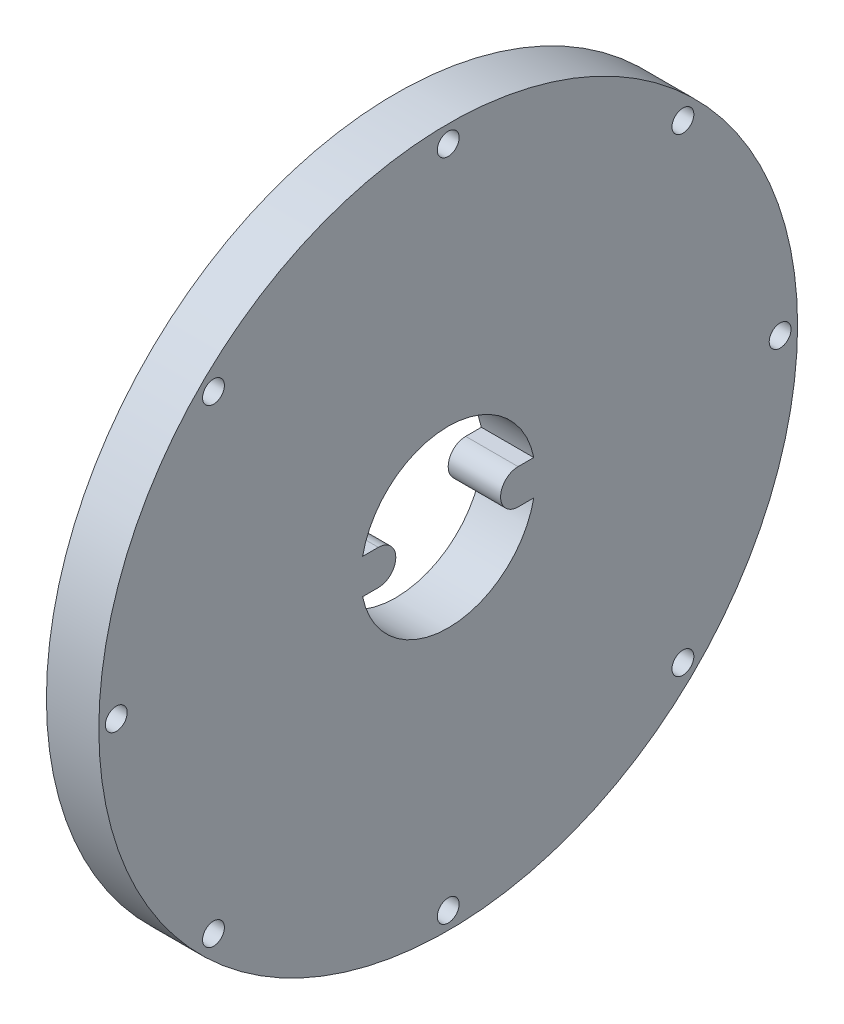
from build123d import *

# Parameters (mm, degrees)
ESQUISSE1_R             = 80
ESQUISSE1_R_2           = 1.5
BOSS_EXTRU_1_DEPTH      = 12
ESQUISSE2_R             = 2.5
ENL_V_MAT_EXTRU_1_DEPTH = 5


with BuildPart() as part:
    # Esquisse1 → Boss.-Extru.1 (new body)
    with BuildSketch(Plane(origin=(0, 0, 0), x_dir=(0, 0, -1), z_dir=(1, 0, 0))):
        Circle(ESQUISSE1_R)
        with Locations((53.74011537, 53.74011537)):
            Circle(ESQUISSE1_R_2, mode=Mode.SUBTRACT)
        with Locations((76, 0)):
            Circle(ESQUISSE1_R_2, mode=Mode.SUBTRACT)
        with Locations((53.74011537, -53.74011537)):
            Circle(ESQUISSE1_R_2, mode=Mode.SUBTRACT)
        with Locations((0, -76)):
            Circle(ESQUISSE1_R_2, mode=Mode.SUBTRACT)
        with Locations((-53.74011537, -53.74011537)):
            Circle(ESQUISSE1_R_2, mode=Mode.SUBTRACT)
        with Locations((-76, 0)):
            Circle(ESQUISSE1_R_2, mode=Mode.SUBTRACT)
        with Locations((-53.74011537, 53.74011537)):
            Circle(ESQUISSE1_R_2, mode=Mode.SUBTRACT)
        with Locations((0, 76)):
            Circle(ESQUISSE1_R_2, mode=Mode.SUBTRACT)
        with BuildLine():
            Line((-16, 4), (-19.595917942, 4))
            ThreePointArc((-19.595917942, 4), (0, 20), (19.595917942, 4))
            Line((19.595917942, 4), (16, 4))
            ThreePointArc((16, 4), (12, 0), (16, -4))
            Line((16, -4), (19.595917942, -4))
            ThreePointArc((19.595917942, -4), (0, -20), (-19.595917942, -4))
            Line((-19.595917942, -4), (-16, -4))
            ThreePointArc((-16, -4), (-12, 0), (-16, 4))
        make_face(mode=Mode.SUBTRACT)
    extrude(amount=BOSS_EXTRU_1_DEPTH)

    # Esquisse2 → Enl_v. mat.-Extru.1 (cut)
    with BuildSketch(Plane(origin=(12, 0, 0), x_dir=(0, 0, -1), z_dir=(1, 0, 0))):
        with Locations((0, 76)):
            Circle(ESQUISSE2_R)
        with Locations((53.74011537, 53.74011537)):
            Circle(ESQUISSE2_R)
        with Locations((76, 0)):
            Circle(ESQUISSE2_R)
        with Locations((53.74011537, -53.74011537)):
            Circle(ESQUISSE2_R)
        with Locations((0, -76)):
            Circle(ESQUISSE2_R)
        with Locations((-53.74011537, -53.74011537)):
            Circle(ESQUISSE2_R)
        with Locations((-76, 0)):
            Circle(ESQUISSE2_R)
        with Locations((-53.74011537, 53.74011537)):
            Circle(ESQUISSE2_R)
    extrude(amount=-ENL_V_MAT_EXTRU_1_DEPTH, mode=Mode.SUBTRACT)


solid = part.part
